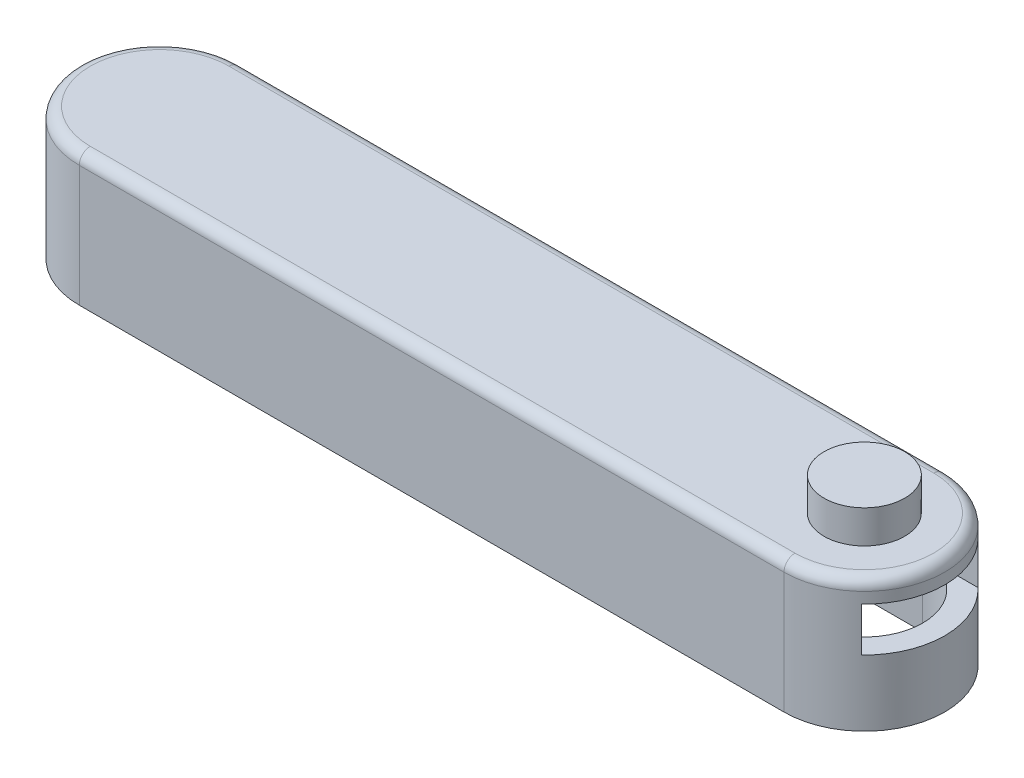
ISO-10303-21;
HEADER;
FILE_DESCRIPTION(('STEP AP214'),'2;1');
FILE_NAME('part.step','',(''),(''),'','','');
FILE_SCHEMA(('AUTOMOTIVE_DESIGN { 1 0 10303 214 1 1 1 1 }'));
ENDSEC;
DATA;
#1=APPLICATION_CONTEXT('core data for automotive mechanical design processes');
#2=APPLICATION_PROTOCOL_DEFINITION('international standard','automotive_design',2000,#1);
#3=PRODUCT_CONTEXT('',#1,'mechanical');
#4=PRODUCT('Part','Part','',(#3));
#5=PRODUCT_RELATED_PRODUCT_CATEGORY('part','',(#4));
#6=PRODUCT_DEFINITION_FORMATION('','',#4);
#7=PRODUCT_DEFINITION_CONTEXT('part definition',#1,'design');
#8=PRODUCT_DEFINITION('design','',#6,#7);
#9=PRODUCT_DEFINITION_SHAPE('','',#8);
#10=(LENGTH_UNIT() NAMED_UNIT(*) SI_UNIT(.MILLI.,.METRE.));
#11=(NAMED_UNIT(*) PLANE_ANGLE_UNIT() SI_UNIT($,.RADIAN.));
#12=(NAMED_UNIT(*) SI_UNIT($,.STERADIAN.) SOLID_ANGLE_UNIT());
#13=UNCERTAINTY_MEASURE_WITH_UNIT(LENGTH_MEASURE(1.E-05),#10,'distance_accuracy_value','');
#14=(GEOMETRIC_REPRESENTATION_CONTEXT(3) GLOBAL_UNCERTAINTY_ASSIGNED_CONTEXT((#13)) GLOBAL_UNIT_ASSIGNED_CONTEXT((#10,
#11,#12)) REPRESENTATION_CONTEXT('',''));
#15=CARTESIAN_POINT('',(0.,0.,0.));
#16=DIRECTION('',(0.,0.,1.));
#17=DIRECTION('',(1.,0.,0.));
#18=AXIS2_PLACEMENT_3D('',#15,#16,#17);
#19=CARTESIAN_POINT('',(203.2,76.2,-46.355));
#20=DIRECTION('',(0.,-1.,0.));
#21=DIRECTION('',(0.,0.,-1.));
#22=AXIS2_PLACEMENT_3D('',#19,#20,#21);
#23=PLANE('',#22);
#24=DIRECTION('',(-1.,0.,0.));
#25=VECTOR('',#24,1.);
#26=CARTESIAN_POINT('',(203.2,76.2,-86.36));
#27=LINE('',#26,#25);
#28=CARTESIAN_POINT('',(203.2,76.2,-86.36));
#29=VERTEX_POINT('',#28);
#30=CARTESIAN_POINT('',(-203.2,76.2,-86.36));
#31=VERTEX_POINT('',#30);
#32=EDGE_CURVE('E228',#29,#31,#27,.T.);
#33=ORIENTED_EDGE('',*,*,#32,.T.);
#34=CARTESIAN_POINT('',(-203.2,76.2,-46.355));
#35=DIRECTION('',(0.,-1.,0.));
#36=DIRECTION('',(0.,0.,-1.));
#37=AXIS2_PLACEMENT_3D('',#34,#35,#36);
#38=CIRCLE('',#37,40.005);
#39=CARTESIAN_POINT('',(-203.2,76.2,-6.35));
#40=VERTEX_POINT('',#39);
#41=EDGE_CURVE('E230',#31,#40,#38,.F.);
#42=ORIENTED_EDGE('',*,*,#41,.T.);
#43=DIRECTION('',(1.,0.,0.));
#44=VECTOR('',#43,1.);
#45=CARTESIAN_POINT('',(203.2,76.2,-6.35));
#46=LINE('',#45,#44);
#47=CARTESIAN_POINT('',(203.2,76.2,-6.35));
#48=VERTEX_POINT('',#47);
#49=EDGE_CURVE('E224',#40,#48,#46,.T.);
#50=ORIENTED_EDGE('',*,*,#49,.T.);
#51=CARTESIAN_POINT('',(203.2,76.2,-46.355));
#52=DIRECTION('',(0.,-1.,0.));
#53=DIRECTION('',(0.,0.,-1.));
#54=AXIS2_PLACEMENT_3D('',#51,#52,#53);
#55=CIRCLE('',#54,40.005);
#56=EDGE_CURVE('E226',#48,#29,#55,.F.);
#57=ORIENTED_EDGE('',*,*,#56,.T.);
#58=EDGE_LOOP('',(#33,#42,#50,#57));
#59=FACE_BOUND('',#58,.T.);
#60=CARTESIAN_POINT('',(203.2,76.2,-46.355));
#61=DIRECTION('',(0.,-1.,0.));
#62=DIRECTION('',(0.,0.,-1.));
#63=AXIS2_PLACEMENT_3D('',#60,#61,#62);
#64=CIRCLE('',#63,23.248637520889);
#65=CARTESIAN_POINT('',(203.2,76.2,-69.603637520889));
#66=VERTEX_POINT('',#65);
#67=EDGE_CURVE('E11',#66,#66,#64,.F.);
#68=ORIENTED_EDGE('',*,*,#67,.F.);
#69=EDGE_LOOP('',(#68));
#70=FACE_BOUND('',#69,.T.);
#71=ADVANCED_FACE('F31',(#59,#70),#23,.F.);
#72=CARTESIAN_POINT('',(0.,76.2,0.));
#73=DIRECTION('',(0.,0.,-1.));
#74=DIRECTION('',(-1.,0.,0.));
#75=AXIS2_PLACEMENT_3D('',#72,#73,#74);
#76=PLANE('',#75);
#77=DIRECTION('',(0.,-1.,0.));
#78=VECTOR('',#77,1.);
#79=CARTESIAN_POINT('',(203.2,76.2,0.));
#80=LINE('',#79,#78);
#81=CARTESIAN_POINT('',(203.2,69.85,0.));
#82=VERTEX_POINT('',#81);
#83=CARTESIAN_POINT('',(203.2,0.,0.));
#84=VERTEX_POINT('',#83);
#85=EDGE_CURVE('E216',#82,#84,#80,.T.);
#86=ORIENTED_EDGE('',*,*,#85,.F.);
#87=DIRECTION('',(1.,0.,0.));
#88=VECTOR('',#87,1.);
#89=CARTESIAN_POINT('',(0.,69.85,0.));
#90=LINE('',#89,#88);
#91=CARTESIAN_POINT('',(-203.2,69.85,0.));
#92=VERTEX_POINT('',#91);
#93=EDGE_CURVE('E39',#82,#92,#90,.F.);
#94=ORIENTED_EDGE('',*,*,#93,.T.);
#95=DIRECTION('',(0.,-1.,0.));
#96=VECTOR('',#95,1.);
#97=CARTESIAN_POINT('',(-203.2,76.2,0.));
#98=LINE('',#97,#96);
#99=CARTESIAN_POINT('',(-203.2,0.,0.));
#100=VERTEX_POINT('',#99);
#101=EDGE_CURVE('E168',#92,#100,#98,.T.);
#102=ORIENTED_EDGE('',*,*,#101,.T.);
#103=DIRECTION('',(1.,0.,0.));
#104=VECTOR('',#103,1.);
#105=CARTESIAN_POINT('',(0.,0.,0.));
#106=LINE('',#105,#104);
#107=EDGE_CURVE('E204',#100,#84,#106,.T.);
#108=ORIENTED_EDGE('',*,*,#107,.T.);
#109=EDGE_LOOP('',(#86,#94,#102,#108));
#110=FACE_BOUND('',#109,.T.);
#111=ADVANCED_FACE('F275',(#110),#76,.F.);
#112=CARTESIAN_POINT('',(203.2,76.2,-46.355));
#113=DIRECTION('',(0.,-1.,0.));
#114=DIRECTION('',(0.,0.,-1.));
#115=AXIS2_PLACEMENT_3D('',#112,#113,#114);
#116=CYLINDRICAL_SURFACE('',#115,46.355);
#117=DIRECTION('',(0.,-1.,0.));
#118=VECTOR('',#117,1.);
#119=CARTESIAN_POINT('',(235.076747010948,76.2,-12.7));
#120=LINE('',#119,#118);
#121=CARTESIAN_POINT('',(235.076747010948,38.1,-12.7));
#122=VERTEX_POINT('',#121);
#123=CARTESIAN_POINT('',(235.076747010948,63.5,-12.7));
#124=VERTEX_POINT('',#123);
#125=EDGE_CURVE('E187',#122,#124,#120,.F.);
#126=ORIENTED_EDGE('',*,*,#125,.T.);
#127=CARTESIAN_POINT('',(203.2,63.5,-46.355));
#128=DIRECTION('',(0.,1.,0.));
#129=DIRECTION('',(0.,0.,1.));
#130=AXIS2_PLACEMENT_3D('',#127,#128,#129);
#131=CIRCLE('',#130,46.355);
#132=CARTESIAN_POINT('',(235.076747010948,63.5,-80.01));
#133=VERTEX_POINT('',#132);
#134=EDGE_CURVE('E218',#124,#133,#131,.T.);
#135=ORIENTED_EDGE('',*,*,#134,.T.);
#136=DIRECTION('',(0.,-1.,0.));
#137=VECTOR('',#136,1.);
#138=CARTESIAN_POINT('',(235.076747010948,76.2,-80.01));
#139=LINE('',#138,#137);
#140=CARTESIAN_POINT('',(235.076747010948,38.1,-80.01));
#141=VERTEX_POINT('',#140);
#142=EDGE_CURVE('E180',#133,#141,#139,.T.);
#143=ORIENTED_EDGE('',*,*,#142,.T.);
#144=CARTESIAN_POINT('',(203.2,38.1,-46.355));
#145=DIRECTION('',(0.,1.,0.));
#146=DIRECTION('',(0.,0.,1.));
#147=AXIS2_PLACEMENT_3D('',#144,#145,#146);
#148=CIRCLE('',#147,46.355);
#149=EDGE_CURVE('E190',#122,#141,#148,.T.);
#150=ORIENTED_EDGE('',*,*,#149,.F.);
#151=EDGE_LOOP('',(#126,#135,#143,#150));
#152=FACE_BOUND('',#151,.T.);
#153=DIRECTION('',(0.,-1.,0.));
#154=VECTOR('',#153,1.);
#155=CARTESIAN_POINT('',(203.2,76.2,-92.71));
#156=LINE('',#155,#154);
#157=CARTESIAN_POINT('',(203.2,69.85,-92.71));
#158=VERTEX_POINT('',#157);
#159=CARTESIAN_POINT('',(203.2,0.,-92.71));
#160=VERTEX_POINT('',#159);
#161=EDGE_CURVE('E214',#158,#160,#156,.T.);
#162=ORIENTED_EDGE('',*,*,#161,.F.);
#163=CARTESIAN_POINT('',(203.2,69.85,-46.355));
#164=DIRECTION('',(0.,-1.,0.));
#165=DIRECTION('',(0.,0.,-1.));
#166=AXIS2_PLACEMENT_3D('',#163,#164,#165);
#167=CIRCLE('',#166,46.355);
#168=EDGE_CURVE('E46',#158,#82,#167,.T.);
#169=ORIENTED_EDGE('',*,*,#168,.T.);
#170=ORIENTED_EDGE('',*,*,#85,.T.);
#171=CARTESIAN_POINT('',(203.2,0.,-46.355));
#172=DIRECTION('',(0.,1.,0.));
#173=DIRECTION('',(0.,0.,-1.));
#174=AXIS2_PLACEMENT_3D('',#171,#172,#173);
#175=CIRCLE('',#174,46.355);
#176=EDGE_CURVE('E208',#84,#160,#175,.T.);
#177=ORIENTED_EDGE('',*,*,#176,.T.);
#178=EDGE_LOOP('',(#162,#169,#170,#177));
#179=FACE_BOUND('',#178,.T.);
#180=ADVANCED_FACE('F276',(#152,#179),#116,.T.);
#181=CARTESIAN_POINT('',(0.,76.2,-92.71));
#182=DIRECTION('',(0.,0.,1.));
#183=DIRECTION('',(1.,0.,0.));
#184=AXIS2_PLACEMENT_3D('',#181,#182,#183);
#185=PLANE('',#184);
#186=DIRECTION('',(0.,-1.,0.));
#187=VECTOR('',#186,1.);
#188=CARTESIAN_POINT('',(-203.2,76.2,-92.71));
#189=LINE('',#188,#187);
#190=CARTESIAN_POINT('',(-203.2,69.85,-92.71));
#191=VERTEX_POINT('',#190);
#192=CARTESIAN_POINT('',(-203.2,0.,-92.71));
#193=VERTEX_POINT('',#192);
#194=EDGE_CURVE('E166',#191,#193,#189,.T.);
#195=ORIENTED_EDGE('',*,*,#194,.F.);
#196=DIRECTION('',(-1.,0.,0.));
#197=VECTOR('',#196,1.);
#198=CARTESIAN_POINT('',(0.,69.85,-92.71));
#199=LINE('',#198,#197);
#200=EDGE_CURVE('E54',#191,#158,#199,.F.);
#201=ORIENTED_EDGE('',*,*,#200,.T.);
#202=ORIENTED_EDGE('',*,*,#161,.T.);
#203=DIRECTION('',(-1.,0.,0.));
#204=VECTOR('',#203,1.);
#205=CARTESIAN_POINT('',(0.,0.,-92.71));
#206=LINE('',#205,#204);
#207=EDGE_CURVE('E211',#160,#193,#206,.T.);
#208=ORIENTED_EDGE('',*,*,#207,.T.);
#209=EDGE_LOOP('',(#195,#201,#202,#208));
#210=FACE_BOUND('',#209,.T.);
#211=ADVANCED_FACE('F267',(#210),#185,.F.);
#212=CARTESIAN_POINT('',(203.2,0.,-46.355));
#213=DIRECTION('',(0.,-1.,0.));
#214=DIRECTION('',(0.,0.,-1.));
#215=AXIS2_PLACEMENT_3D('',#212,#213,#214);
#216=PLANE('',#215);
#217=ORIENTED_EDGE('',*,*,#107,.F.);
#218=CARTESIAN_POINT('',(-203.2,0.,-46.355));
#219=DIRECTION('',(0.,-1.,0.));
#220=DIRECTION('',(0.,0.,-1.));
#221=AXIS2_PLACEMENT_3D('',#218,#219,#220);
#222=CIRCLE('',#221,46.355);
#223=EDGE_CURVE('E160',#100,#193,#222,.T.);
#224=ORIENTED_EDGE('',*,*,#223,.T.);
#225=ORIENTED_EDGE('',*,*,#207,.F.);
#226=ORIENTED_EDGE('',*,*,#176,.F.);
#227=EDGE_LOOP('',(#217,#224,#225,#226));
#228=FACE_BOUND('',#227,.T.);
#229=DIRECTION('',(-1.,0.,0.));
#230=VECTOR('',#229,1.);
#231=CARTESIAN_POINT('',(203.2,0.,-12.7));
#232=LINE('',#231,#230);
#233=CARTESIAN_POINT('',(203.2,0.,-12.7));
#234=VERTEX_POINT('',#233);
#235=CARTESIAN_POINT('',(-203.2,0.,-12.7));
#236=VERTEX_POINT('',#235);
#237=EDGE_CURVE('E192',#234,#236,#232,.T.);
#238=ORIENTED_EDGE('',*,*,#237,.F.);
#239=CARTESIAN_POINT('',(203.2,0.,-46.355));
#240=DIRECTION('',(0.,-1.,0.));
#241=DIRECTION('',(0.,0.,-1.));
#242=AXIS2_PLACEMENT_3D('',#239,#240,#241);
#243=CIRCLE('',#242,33.655);
#244=CARTESIAN_POINT('',(203.2,0.,-80.01));
#245=VERTEX_POINT('',#244);
#246=EDGE_CURVE('E196',#245,#234,#243,.T.);
#247=ORIENTED_EDGE('',*,*,#246,.F.);
#248=DIRECTION('',(1.,0.,0.));
#249=VECTOR('',#248,1.);
#250=CARTESIAN_POINT('',(0.,0.,-80.01));
#251=LINE('',#250,#249);
#252=CARTESIAN_POINT('',(-203.2,0.,-80.01));
#253=VERTEX_POINT('',#252);
#254=EDGE_CURVE('E198',#253,#245,#251,.T.);
#255=ORIENTED_EDGE('',*,*,#254,.F.);
#256=CARTESIAN_POINT('',(-203.2,0.,-46.355));
#257=DIRECTION('',(0.,1.,0.));
#258=DIRECTION('',(0.,0.,-1.));
#259=AXIS2_PLACEMENT_3D('',#256,#257,#258);
#260=CIRCLE('',#259,33.655);
#261=EDGE_CURVE('E154',#253,#236,#260,.T.);
#262=ORIENTED_EDGE('',*,*,#261,.T.);
#263=EDGE_LOOP('',(#238,#247,#255,#262));
#264=FACE_BOUND('',#263,.T.);
#265=ADVANCED_FACE('F272',(#228,#264),#216,.T.);
#266=CARTESIAN_POINT('',(203.2,38.1,-12.7));
#267=DIRECTION('',(0.,0.,1.));
#268=DIRECTION('',(1.,0.,0.));
#269=AXIS2_PLACEMENT_3D('',#266,#267,#268);
#270=PLANE('',#269);
#271=ORIENTED_EDGE('',*,*,#237,.T.);
#272=DIRECTION('',(0.,-1.,0.));
#273=VECTOR('',#272,1.);
#274=CARTESIAN_POINT('',(-203.2,38.1,-12.7));
#275=LINE('',#274,#273);
#276=CARTESIAN_POINT('',(-203.2,38.1,-12.7));
#277=VERTEX_POINT('',#276);
#278=EDGE_CURVE('E158',#277,#236,#275,.T.);
#279=ORIENTED_EDGE('',*,*,#278,.F.);
#280=DIRECTION('',(1.,0.,0.));
#281=VECTOR('',#280,1.);
#282=CARTESIAN_POINT('',(0.,38.1,-12.7));
#283=LINE('',#282,#281);
#284=CARTESIAN_POINT('',(-235.076747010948,38.1,-12.7));
#285=VERTEX_POINT('',#284);
#286=EDGE_CURVE('E145',#285,#277,#283,.T.);
#287=ORIENTED_EDGE('',*,*,#286,.F.);
#288=DIRECTION('',(0.,-1.,0.));
#289=VECTOR('',#288,1.);
#290=CARTESIAN_POINT('',(-235.076747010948,76.2,-12.7));
#291=LINE('',#290,#289);
#292=CARTESIAN_POINT('',(-235.076747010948,63.5,-12.7));
#293=VERTEX_POINT('',#292);
#294=EDGE_CURVE('E309',#285,#293,#291,.F.);
#295=ORIENTED_EDGE('',*,*,#294,.T.);
#296=DIRECTION('',(-1.,0.,0.));
#297=VECTOR('',#296,1.);
#298=CARTESIAN_POINT('',(0.,63.5,-12.7));
#299=LINE('',#298,#297);
#300=EDGE_CURVE('E177',#124,#293,#299,.T.);
#301=ORIENTED_EDGE('',*,*,#300,.F.);
#302=ORIENTED_EDGE('',*,*,#125,.F.);
#303=DIRECTION('',(-1.,0.,0.));
#304=VECTOR('',#303,1.);
#305=CARTESIAN_POINT('',(0.,38.1,-12.7));
#306=LINE('',#305,#304);
#307=CARTESIAN_POINT('',(203.2,38.1,-12.7));
#308=VERTEX_POINT('',#307);
#309=EDGE_CURVE('E178',#122,#308,#306,.T.);
#310=ORIENTED_EDGE('',*,*,#309,.T.);
#311=DIRECTION('',(0.,-1.,0.));
#312=VECTOR('',#311,1.);
#313=CARTESIAN_POINT('',(203.2,38.1,-12.7));
#314=LINE('',#313,#312);
#315=EDGE_CURVE('E202',#308,#234,#314,.T.);
#316=ORIENTED_EDGE('',*,*,#315,.T.);
#317=EDGE_LOOP('',(#271,#279,#287,#295,#301,#302,#310,#316));
#318=FACE_BOUND('',#317,.T.);
#319=ADVANCED_FACE('F292',(#318),#270,.F.);
#320=CARTESIAN_POINT('',(203.2,38.1,-46.355));
#321=DIRECTION('',(0.,-1.,0.));
#322=DIRECTION('',(0.,0.,-1.));
#323=AXIS2_PLACEMENT_3D('',#320,#321,#322);
#324=CYLINDRICAL_SURFACE('',#323,33.655);
#325=ORIENTED_EDGE('',*,*,#246,.T.);
#326=ORIENTED_EDGE('',*,*,#315,.F.);
#327=CARTESIAN_POINT('',(203.2,38.1,-46.355));
#328=DIRECTION('',(0.,-1.,0.));
#329=DIRECTION('',(0.,0.,-1.));
#330=AXIS2_PLACEMENT_3D('',#327,#328,#329);
#331=CIRCLE('',#330,33.655);
#332=CARTESIAN_POINT('',(203.2,38.1,-80.01));
#333=VERTEX_POINT('',#332);
#334=EDGE_CURVE('E193',#333,#308,#331,.T.);
#335=ORIENTED_EDGE('',*,*,#334,.F.);
#336=DIRECTION('',(0.,-1.,0.));
#337=VECTOR('',#336,1.);
#338=CARTESIAN_POINT('',(203.2,38.1,-80.01));
#339=LINE('',#338,#337);
#340=EDGE_CURVE('E195',#333,#245,#339,.T.);
#341=ORIENTED_EDGE('',*,*,#340,.T.);
#342=EDGE_LOOP('',(#325,#326,#335,#341));
#343=FACE_BOUND('',#342,.T.);
#344=ADVANCED_FACE('F298',(#343),#324,.F.);
#345=CARTESIAN_POINT('',(0.,38.1,-80.01));
#346=DIRECTION('',(0.,0.,-1.));
#347=DIRECTION('',(-1.,0.,0.));
#348=AXIS2_PLACEMENT_3D('',#345,#346,#347);
#349=PLANE('',#348);
#350=ORIENTED_EDGE('',*,*,#254,.T.);
#351=ORIENTED_EDGE('',*,*,#340,.F.);
#352=DIRECTION('',(1.,0.,0.));
#353=VECTOR('',#352,1.);
#354=CARTESIAN_POINT('',(0.,38.1,-80.01));
#355=LINE('',#354,#353);
#356=EDGE_CURVE('E173',#333,#141,#355,.T.);
#357=ORIENTED_EDGE('',*,*,#356,.T.);
#358=ORIENTED_EDGE('',*,*,#142,.F.);
#359=DIRECTION('',(1.,0.,0.));
#360=VECTOR('',#359,1.);
#361=CARTESIAN_POINT('',(0.,63.5,-80.01));
#362=LINE('',#361,#360);
#363=CARTESIAN_POINT('',(-235.076747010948,63.5,-80.01));
#364=VERTEX_POINT('',#363);
#365=EDGE_CURVE('E174',#364,#133,#362,.T.);
#366=ORIENTED_EDGE('',*,*,#365,.F.);
#367=DIRECTION('',(0.,-1.,0.));
#368=VECTOR('',#367,1.);
#369=CARTESIAN_POINT('',(-235.076747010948,76.2,-80.01));
#370=LINE('',#369,#368);
#371=CARTESIAN_POINT('',(-235.076747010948,38.1,-80.01));
#372=VERTEX_POINT('',#371);
#373=EDGE_CURVE('E141',#364,#372,#370,.T.);
#374=ORIENTED_EDGE('',*,*,#373,.T.);
#375=DIRECTION('',(-1.,0.,0.));
#376=VECTOR('',#375,1.);
#377=CARTESIAN_POINT('',(0.,38.1,-80.01));
#378=LINE('',#377,#376);
#379=CARTESIAN_POINT('',(-203.2,38.1,-80.01));
#380=VERTEX_POINT('',#379);
#381=EDGE_CURVE('E133',#380,#372,#378,.T.);
#382=ORIENTED_EDGE('',*,*,#381,.F.);
#383=DIRECTION('',(0.,-1.,0.));
#384=VECTOR('',#383,1.);
#385=CARTESIAN_POINT('',(-203.2,38.1,-80.01));
#386=LINE('',#385,#384);
#387=EDGE_CURVE('E138',#380,#253,#386,.T.);
#388=ORIENTED_EDGE('',*,*,#387,.T.);
#389=EDGE_LOOP('',(#350,#351,#357,#358,#366,#374,#382,#388));
#390=FACE_BOUND('',#389,.T.);
#391=ADVANCED_FACE('F136',(#390),#349,.F.);
#392=CARTESIAN_POINT('',(0.,63.5,-12.7));
#393=DIRECTION('',(0.,1.,0.));
#394=DIRECTION('',(0.,0.,1.));
#395=AXIS2_PLACEMENT_3D('',#392,#393,#394);
#396=PLANE('',#395);
#397=ORIENTED_EDGE('',*,*,#300,.T.);
#398=CARTESIAN_POINT('',(-203.2,63.5,-46.355));
#399=DIRECTION('',(0.,-1.,0.));
#400=DIRECTION('',(0.,0.,1.));
#401=AXIS2_PLACEMENT_3D('',#398,#399,#400);
#402=CIRCLE('',#401,46.355);
#403=EDGE_CURVE('E170',#293,#364,#402,.T.);
#404=ORIENTED_EDGE('',*,*,#403,.T.);
#405=ORIENTED_EDGE('',*,*,#365,.T.);
#406=ORIENTED_EDGE('',*,*,#134,.F.);
#407=EDGE_LOOP('',(#397,#404,#405,#406));
#408=FACE_BOUND('',#407,.T.);
#409=ADVANCED_FACE('F341',(#408),#396,.F.);
#410=CARTESIAN_POINT('',(0.,38.1,-12.7));
#411=DIRECTION('',(0.,1.,0.));
#412=DIRECTION('',(0.,0.,1.));
#413=AXIS2_PLACEMENT_3D('',#410,#411,#412);
#414=PLANE('',#413);
#415=ORIENTED_EDGE('',*,*,#149,.T.);
#416=ORIENTED_EDGE('',*,*,#356,.F.);
#417=ORIENTED_EDGE('',*,*,#334,.T.);
#418=ORIENTED_EDGE('',*,*,#309,.F.);
#419=EDGE_LOOP('',(#415,#416,#417,#418));
#420=FACE_BOUND('',#419,.T.);
#421=ADVANCED_FACE('F339',(#420),#414,.T.);
#422=CARTESIAN_POINT('',(-203.2,76.2,-46.355));
#423=DIRECTION('',(0.,-1.,0.));
#424=DIRECTION('',(0.,0.,-1.));
#425=AXIS2_PLACEMENT_3D('',#422,#423,#424);
#426=CYLINDRICAL_SURFACE('',#425,46.355);
#427=ORIENTED_EDGE('',*,*,#294,.F.);
#428=CARTESIAN_POINT('',(-203.2,38.1,-46.355));
#429=DIRECTION('',(0.,-1.,0.));
#430=DIRECTION('',(0.,0.,1.));
#431=AXIS2_PLACEMENT_3D('',#428,#429,#430);
#432=CIRCLE('',#431,46.355);
#433=EDGE_CURVE('E308',#285,#372,#432,.T.);
#434=ORIENTED_EDGE('',*,*,#433,.T.);
#435=ORIENTED_EDGE('',*,*,#373,.F.);
#436=ORIENTED_EDGE('',*,*,#403,.F.);
#437=EDGE_LOOP('',(#427,#434,#435,#436));
#438=FACE_BOUND('',#437,.T.);
#439=ORIENTED_EDGE('',*,*,#101,.F.);
#440=CARTESIAN_POINT('',(-203.2,69.85,-46.355));
#441=DIRECTION('',(0.,-1.,0.));
#442=DIRECTION('',(0.,0.,-1.));
#443=AXIS2_PLACEMENT_3D('',#440,#441,#442);
#444=CIRCLE('',#443,46.355);
#445=EDGE_CURVE('E221',#92,#191,#444,.T.);
#446=ORIENTED_EDGE('',*,*,#445,.T.);
#447=ORIENTED_EDGE('',*,*,#194,.T.);
#448=ORIENTED_EDGE('',*,*,#223,.F.);
#449=EDGE_LOOP('',(#439,#446,#447,#448));
#450=FACE_BOUND('',#449,.T.);
#451=ADVANCED_FACE('F265',(#438,#450),#426,.T.);
#452=CARTESIAN_POINT('',(-203.2,38.1,-46.355));
#453=DIRECTION('',(0.,-1.,0.));
#454=DIRECTION('',(0.,0.,-1.));
#455=AXIS2_PLACEMENT_3D('',#452,#453,#454);
#456=CYLINDRICAL_SURFACE('',#455,33.655);
#457=ORIENTED_EDGE('',*,*,#261,.F.);
#458=ORIENTED_EDGE('',*,*,#387,.F.);
#459=CARTESIAN_POINT('',(-203.2,38.1,-46.355));
#460=DIRECTION('',(0.,1.,0.));
#461=DIRECTION('',(0.,0.,-1.));
#462=AXIS2_PLACEMENT_3D('',#459,#460,#461);
#463=CIRCLE('',#462,33.655);
#464=EDGE_CURVE('E149',#380,#277,#463,.T.);
#465=ORIENTED_EDGE('',*,*,#464,.T.);
#466=ORIENTED_EDGE('',*,*,#278,.T.);
#467=EDGE_LOOP('',(#457,#458,#465,#466));
#468=FACE_BOUND('',#467,.T.);
#469=ADVANCED_FACE('F156',(#468),#456,.F.);
#470=CARTESIAN_POINT('',(0.,38.1,-12.7));
#471=DIRECTION('',(0.,1.,0.));
#472=DIRECTION('',(0.,0.,1.));
#473=AXIS2_PLACEMENT_3D('',#470,#471,#472);
#474=PLANE('',#473);
#475=ORIENTED_EDGE('',*,*,#433,.F.);
#476=ORIENTED_EDGE('',*,*,#286,.T.);
#477=ORIENTED_EDGE('',*,*,#464,.F.);
#478=ORIENTED_EDGE('',*,*,#381,.T.);
#479=EDGE_LOOP('',(#475,#476,#477,#478));
#480=FACE_BOUND('',#479,.T.);
#481=ADVANCED_FACE('F150',(#480),#474,.T.);
#482=CARTESIAN_POINT('',(203.2,69.85,-46.355));
#483=DIRECTION('',(0.,-1.,0.));
#484=DIRECTION('',(0.,0.,-1.));
#485=AXIS2_PLACEMENT_3D('',#482,#483,#484);
#486=TOROIDAL_SURFACE('',#485,40.005,6.35);
#487=CARTESIAN_POINT('',(203.2,69.85,-86.36));
#488=DIRECTION('',(-1.,0.,0.));
#489=DIRECTION('',(0.,0.,1.));
#490=AXIS2_PLACEMENT_3D('',#487,#488,#489);
#491=CIRCLE('',#490,6.35);
#492=EDGE_CURVE('E241',#29,#158,#491,.T.);
#493=ORIENTED_EDGE('',*,*,#492,.F.);
#494=ORIENTED_EDGE('',*,*,#56,.F.);
#495=CARTESIAN_POINT('',(203.2,69.85,-6.35));
#496=DIRECTION('',(-1.,0.,0.));
#497=DIRECTION('',(0.,0.,1.));
#498=AXIS2_PLACEMENT_3D('',#495,#496,#497);
#499=CIRCLE('',#498,6.35);
#500=EDGE_CURVE('E146',#82,#48,#499,.T.);
#501=ORIENTED_EDGE('',*,*,#500,.F.);
#502=ORIENTED_EDGE('',*,*,#168,.F.);
#503=EDGE_LOOP('',(#493,#494,#501,#502));
#504=FACE_BOUND('',#503,.T.);
#505=ADVANCED_FACE('F33',(#504),#486,.T.);
#506=CARTESIAN_POINT('',(203.2,69.85,-6.35));
#507=DIRECTION('',(1.,0.,0.));
#508=DIRECTION('',(0.,0.,-1.));
#509=AXIS2_PLACEMENT_3D('',#506,#507,#508);
#510=CYLINDRICAL_SURFACE('',#509,6.35);
#511=ORIENTED_EDGE('',*,*,#500,.T.);
#512=ORIENTED_EDGE('',*,*,#49,.F.);
#513=CARTESIAN_POINT('',(-203.2,69.85,-6.35));
#514=DIRECTION('',(-1.,0.,0.));
#515=DIRECTION('',(0.,0.,1.));
#516=AXIS2_PLACEMENT_3D('',#513,#514,#515);
#517=CIRCLE('',#516,6.35);
#518=EDGE_CURVE('E238',#92,#40,#517,.T.);
#519=ORIENTED_EDGE('',*,*,#518,.F.);
#520=ORIENTED_EDGE('',*,*,#93,.F.);
#521=EDGE_LOOP('',(#511,#512,#519,#520));
#522=FACE_BOUND('',#521,.T.);
#523=ADVANCED_FACE('F248',(#522),#510,.T.);
#524=CARTESIAN_POINT('',(203.2,69.85,-86.36));
#525=DIRECTION('',(-1.,0.,0.));
#526=DIRECTION('',(0.,0.,1.));
#527=AXIS2_PLACEMENT_3D('',#524,#525,#526);
#528=CYLINDRICAL_SURFACE('',#527,6.35);
#529=ORIENTED_EDGE('',*,*,#492,.T.);
#530=ORIENTED_EDGE('',*,*,#200,.F.);
#531=CARTESIAN_POINT('',(-203.2,69.85,-86.36));
#532=DIRECTION('',(-1.,0.,0.));
#533=DIRECTION('',(0.,0.,1.));
#534=AXIS2_PLACEMENT_3D('',#531,#532,#533);
#535=CIRCLE('',#534,6.35);
#536=EDGE_CURVE('E236',#31,#191,#535,.T.);
#537=ORIENTED_EDGE('',*,*,#536,.F.);
#538=ORIENTED_EDGE('',*,*,#32,.F.);
#539=EDGE_LOOP('',(#529,#530,#537,#538));
#540=FACE_BOUND('',#539,.T.);
#541=ADVANCED_FACE('F262',(#540),#528,.T.);
#542=CARTESIAN_POINT('',(-203.2,69.85,-46.355));
#543=DIRECTION('',(0.,-1.,0.));
#544=DIRECTION('',(0.,0.,-1.));
#545=AXIS2_PLACEMENT_3D('',#542,#543,#544);
#546=TOROIDAL_SURFACE('',#545,40.005,6.35);
#547=ORIENTED_EDGE('',*,*,#518,.T.);
#548=ORIENTED_EDGE('',*,*,#41,.F.);
#549=ORIENTED_EDGE('',*,*,#536,.T.);
#550=ORIENTED_EDGE('',*,*,#445,.F.);
#551=EDGE_LOOP('',(#547,#548,#549,#550));
#552=FACE_BOUND('',#551,.T.);
#553=ADVANCED_FACE('F259',(#552),#546,.T.);
#554=CARTESIAN_POINT('',(203.2,95.25,-46.355));
#555=DIRECTION('',(0.,-1.,0.));
#556=DIRECTION('',(0.,0.,-1.));
#557=AXIS2_PLACEMENT_3D('',#554,#555,#556);
#558=CYLINDRICAL_SURFACE('',#557,23.248637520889);
#559=CARTESIAN_POINT('',(203.2,95.25,-46.355));
#560=DIRECTION('',(0.,1.,0.));
#561=DIRECTION('',(0.,0.,1.));
#562=AXIS2_PLACEMENT_3D('',#559,#560,#561);
#563=CIRCLE('',#562,23.248637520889);
#564=CARTESIAN_POINT('',(203.2,95.25,-69.603637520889));
#565=VERTEX_POINT('',#564);
#566=EDGE_CURVE('E239',#565,#565,#563,.T.);
#567=CARTESIAN_POINT('',(203.2,95.25,-69.603637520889));
#568=CARTESIAN_POINT('',(203.2,95.0515625,-69.603637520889));
#569=CARTESIAN_POINT('',(203.2,94.853125,-69.603637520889));
#570=CARTESIAN_POINT('',(203.2,94.45625,-69.603637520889));
#571=CARTESIAN_POINT('',(203.2,94.2578125,-69.603637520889));
#572=CARTESIAN_POINT('',(203.2,93.8609375,-69.603637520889));
#573=CARTESIAN_POINT('',(203.2,93.6625,-69.603637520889));
#574=CARTESIAN_POINT('',(203.2,93.265625,-69.603637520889));
#575=CARTESIAN_POINT('',(203.2,93.0671875,-69.603637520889));
#576=CARTESIAN_POINT('',(203.2,92.6703125,-69.603637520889));
#577=CARTESIAN_POINT('',(203.2,92.471875,-69.603637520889));
#578=CARTESIAN_POINT('',(203.2,92.075,-69.603637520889));
#579=CARTESIAN_POINT('',(203.2,91.8765625,-69.603637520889));
#580=CARTESIAN_POINT('',(203.2,91.4796875,-69.603637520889));
#581=CARTESIAN_POINT('',(203.2,91.28125,-69.603637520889));
#582=CARTESIAN_POINT('',(203.2,90.884375,-69.603637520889));
#583=CARTESIAN_POINT('',(203.2,90.6859375,-69.603637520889));
#584=CARTESIAN_POINT('',(203.2,90.2890625,-69.603637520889));
#585=CARTESIAN_POINT('',(203.2,90.090625,-69.603637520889));
#586=CARTESIAN_POINT('',(203.2,89.69375,-69.603637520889));
#587=CARTESIAN_POINT('',(203.2,89.4953125,-69.603637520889));
#588=CARTESIAN_POINT('',(203.2,89.0984375,-69.603637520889));
#589=CARTESIAN_POINT('',(203.2,88.9,-69.603637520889));
#590=CARTESIAN_POINT('',(203.2,88.503125,-69.603637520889));
#591=CARTESIAN_POINT('',(203.2,88.3046875,-69.603637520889));
#592=CARTESIAN_POINT('',(203.2,87.9078125,-69.603637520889));
#593=CARTESIAN_POINT('',(203.2,87.709375,-69.603637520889));
#594=CARTESIAN_POINT('',(203.2,87.3125,-69.603637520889));
#595=CARTESIAN_POINT('',(203.2,87.1140625,-69.603637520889));
#596=CARTESIAN_POINT('',(203.2,86.7171875,-69.603637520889));
#597=CARTESIAN_POINT('',(203.2,86.51875,-69.603637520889));
#598=CARTESIAN_POINT('',(203.2,86.121875,-69.603637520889));
#599=CARTESIAN_POINT('',(203.2,85.9234375,-69.603637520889));
#600=CARTESIAN_POINT('',(203.2,85.5265625,-69.603637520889));
#601=CARTESIAN_POINT('',(203.2,85.328125,-69.603637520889));
#602=CARTESIAN_POINT('',(203.2,84.93125,-69.603637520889));
#603=CARTESIAN_POINT('',(203.2,84.7328125,-69.603637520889));
#604=CARTESIAN_POINT('',(203.2,84.3359375,-69.603637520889));
#605=CARTESIAN_POINT('',(203.2,84.1375,-69.603637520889));
#606=CARTESIAN_POINT('',(203.2,83.740625,-69.603637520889));
#607=CARTESIAN_POINT('',(203.2,83.5421875,-69.603637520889));
#608=CARTESIAN_POINT('',(203.2,83.1453125,-69.603637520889));
#609=CARTESIAN_POINT('',(203.2,82.946875,-69.603637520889));
#610=CARTESIAN_POINT('',(203.2,82.55,-69.603637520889));
#611=CARTESIAN_POINT('',(203.2,82.3515625,-69.603637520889));
#612=CARTESIAN_POINT('',(203.2,81.9546875,-69.603637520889));
#613=CARTESIAN_POINT('',(203.2,81.75625,-69.603637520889));
#614=CARTESIAN_POINT('',(203.2,81.359375,-69.603637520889));
#615=CARTESIAN_POINT('',(203.2,81.1609375,-69.603637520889));
#616=CARTESIAN_POINT('',(203.2,80.7640625,-69.603637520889));
#617=CARTESIAN_POINT('',(203.2,80.565625,-69.603637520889));
#618=CARTESIAN_POINT('',(203.2,80.16875,-69.603637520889));
#619=CARTESIAN_POINT('',(203.2,79.9703125,-69.603637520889));
#620=CARTESIAN_POINT('',(203.2,79.5734375,-69.603637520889));
#621=CARTESIAN_POINT('',(203.2,79.375,-69.603637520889));
#622=CARTESIAN_POINT('',(203.2,78.978125,-69.603637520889));
#623=CARTESIAN_POINT('',(203.2,78.7796875,-69.603637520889));
#624=CARTESIAN_POINT('',(203.2,78.3828125,-69.603637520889));
#625=CARTESIAN_POINT('',(203.2,78.184375,-69.603637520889));
#626=CARTESIAN_POINT('',(203.2,77.7875,-69.603637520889));
#627=CARTESIAN_POINT('',(203.2,77.5890625,-69.603637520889));
#628=CARTESIAN_POINT('',(203.2,77.1921875,-69.603637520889));
#629=CARTESIAN_POINT('',(203.2,76.99375,-69.603637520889));
#630=CARTESIAN_POINT('',(203.2,76.596875,-69.603637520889));
#631=CARTESIAN_POINT('',(203.2,76.3984375,-69.603637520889));
#632=CARTESIAN_POINT('',(203.2,76.2,-69.603637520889));
#633=B_SPLINE_CURVE_WITH_KNOTS('',3,(#567,#568,#569,#570,#571,#572,#573,#574,#575,#576,#577,
#578,#579,#580,#581,#582,#583,#584,#585,#586,#587,#588,#589,#590,#591,#592,#593,#594,#595,#596,
#597,#598,#599,#600,#601,#602,#603,#604,#605,#606,#607,#608,#609,#610,#611,#612,#613,#614,#615,
#616,#617,#618,#619,#620,#621,#622,#623,#624,#625,#626,#627,#628,#629,#630,#631,#632),
.UNSPECIFIED.,.F.,.F.,(4,2,2,2,2,2,2,2,2,2,2,2,2,2,2,2,2,2,2,2,2,2,2,2,2,2,2,2,2,2,2,2,4),(0.,
0.595312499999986,1.19062499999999,1.78593749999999,2.38124999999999,2.97656249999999,
3.57187499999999,4.16718749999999,4.76249999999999,5.35781249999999,5.95312499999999,
6.54843749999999,7.14374999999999,7.73906249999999,8.33437499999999,8.92968749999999,
9.52499999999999,10.1203125,10.715625,11.3109375,11.90625,12.5015625,13.096875,13.6921875,
14.2875,14.8828125,15.478125,16.0734375,16.66875,17.2640625,17.859375,18.4546875,19.05),.UNSPECIFIED.);
#634=EDGE_CURVE('BSEAM321',#565,#66,#633,.T.);
#635=ORIENTED_EDGE('',*,*,#566,.F.);
#636=ORIENTED_EDGE('',*,*,#67,.T.);
#637=ORIENTED_EDGE('',*,*,#634,.T.);
#638=ORIENTED_EDGE('',*,*,#634,.F.);
#639=EDGE_LOOP('',(#635,#637,#636,#638));
#640=FACE_BOUND('',#639,.T.);
#641=ADVANCED_FACE('F321',(#640),#558,.T.);
#642=CARTESIAN_POINT('',(203.2,95.25,-46.355));
#643=DIRECTION('',(0.,1.,0.));
#644=DIRECTION('',(0.,0.,1.));
#645=AXIS2_PLACEMENT_3D('',#642,#643,#644);
#646=PLANE('',#645);
#647=ORIENTED_EDGE('',*,*,#566,.T.);
#648=EDGE_LOOP('',(#647));
#649=FACE_BOUND('',#648,.T.);
#650=ADVANCED_FACE('F319',(#649),#646,.T.);
#651=CLOSED_SHELL('',(#71,#111,#180,#211,#265,#319,#344,#391,#409,#421,#451,#469,#481,#505,#523,
#541,#553,#641,#650));
#652=MANIFOLD_SOLID_BREP('B2',#651);
#653=ADVANCED_BREP_SHAPE_REPRESENTATION('',(#18,#652),#14);
#654=SHAPE_DEFINITION_REPRESENTATION(#9,#653);
ENDSEC;
END-ISO-10303-21;
